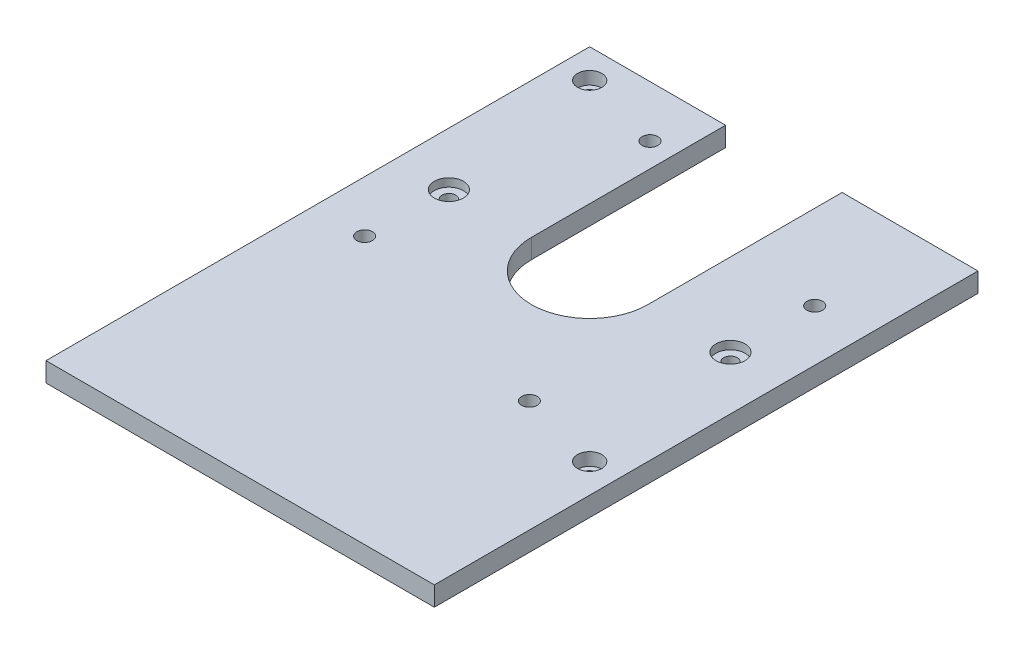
from build123d import *

# Parameters (mm, degrees)
SKETCH1_W                                           = 127
SKETCH1_H                                           = 127
BOSS_EXTRUDE1_DEPTH                                 = 6.35
CBORE_FOR_8_BINDING_HEAD_MACHINE_SCREW1_D           = 4.4958
CBORE_FOR_8_BINDING_HEAD_MACHINE_SCREW1_DEPTH       = 9.398
CBORE_FOR_8_BINDING_HEAD_MACHINE_SCREW1_CBORE_D     = 9.525
CBORE_FOR_8_BINDING_HEAD_MACHINE_SCREW1_CBORE_DEPTH = 2.667
CBORE_FOR_8_BINDING_HEAD_MACHINE_SCREW1_TIP         = 1.350674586
CBORE_FOR_8_SOCKET_HEAD_CAP_SCREW1_D                = 4.4958
CBORE_FOR_8_SOCKET_HEAD_CAP_SCREW1_DEPTH            = 9.398
CBORE_FOR_8_SOCKET_HEAD_CAP_SCREW1_CBORE_D          = 7.9375
CBORE_FOR_8_SOCKET_HEAD_CAP_SCREW1_CBORE_DEPTH      = 4.1656
CBORE_FOR_8_SOCKET_HEAD_CAP_SCREW1_TIP              = 1.350674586
F_1_4_20_TAPPED_HOLE1_D                             = 5.1054
F_1_4_20_TAPPED_HOLE1_DEPTH                         = 16.51
F_1_4_20_TAPPED_HOLE1_TIP                           = 1.533816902
CUT_EXTRUDE1_DEPTH                                  = 91.02678768
SKETCH9_W                                           = 127
SKETCH9_H                                           = 6.35
BOSS_EXTRUDE2_DEPTH                                 = 50.8


with BuildPart() as part:
    # Sketch1 → Boss-Extrude1 (new body)
    with BuildSketch(Plane(origin=(0, 0, 0), x_dir=(1, 0, 0), z_dir=(0, 1, 0))):
        Rectangle(SKETCH1_W, SKETCH1_H)
    extrude(amount=BOSS_EXTRUDE1_DEPTH)

    # CBORE for _8 Binding Head Machine Screw1
    with Locations(Plane(origin=(0, 6.35, 0), x_dir=(1, 0, 0), z_dir=(0, 1, 0))):
        with Locations((-46.0502, 0), (46.0502, 0)):
            CounterBoreHole(CBORE_FOR_8_BINDING_HEAD_MACHINE_SCREW1_D / 2, CBORE_FOR_8_BINDING_HEAD_MACHINE_SCREW1_CBORE_D / 2, CBORE_FOR_8_BINDING_HEAD_MACHINE_SCREW1_CBORE_DEPTH, depth=CBORE_FOR_8_BINDING_HEAD_MACHINE_SCREW1_DEPTH)
            with Locations((0, 0, -(CBORE_FOR_8_BINDING_HEAD_MACHINE_SCREW1_DEPTH + CBORE_FOR_8_BINDING_HEAD_MACHINE_SCREW1_TIP / 2))):  # 118° drill point
                Cone(0, CBORE_FOR_8_BINDING_HEAD_MACHINE_SCREW1_D / 2, CBORE_FOR_8_BINDING_HEAD_MACHINE_SCREW1_TIP, mode=Mode.SUBTRACT)

    # CBORE for _8 Socket Head Cap Screw1
    with Locations(Plane(origin=(0, 6.35, 0), x_dir=(1, 0, 0), z_dir=(0, 1, 0))):
        with Locations((-53.975, 53.975), (53.975, -53.975)):
            CounterBoreHole(CBORE_FOR_8_SOCKET_HEAD_CAP_SCREW1_D / 2, CBORE_FOR_8_SOCKET_HEAD_CAP_SCREW1_CBORE_D / 2, CBORE_FOR_8_SOCKET_HEAD_CAP_SCREW1_CBORE_DEPTH, depth=CBORE_FOR_8_SOCKET_HEAD_CAP_SCREW1_DEPTH)
            with Locations((0, 0, -(CBORE_FOR_8_SOCKET_HEAD_CAP_SCREW1_DEPTH + CBORE_FOR_8_SOCKET_HEAD_CAP_SCREW1_TIP / 2))):  # 118° drill point
                Cone(0, CBORE_FOR_8_SOCKET_HEAD_CAP_SCREW1_D / 2, CBORE_FOR_8_SOCKET_HEAD_CAP_SCREW1_TIP, mode=Mode.SUBTRACT)

    # 1_4-20 Tapped Hole1
    with Locations(Plane(origin=(0, 6.35, 0), x_dir=(1, 0, 0), z_dir=(0, 1, 0))):
        with Locations((-26.94051, 46.662332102), (-46.65990472, -26.939108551), (26.940006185, -46.661459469), (46.662331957, 26.940509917)):
            Hole(F_1_4_20_TAPPED_HOLE1_D / 2, depth=F_1_4_20_TAPPED_HOLE1_DEPTH)
            with Locations((0, 0, -(F_1_4_20_TAPPED_HOLE1_DEPTH + F_1_4_20_TAPPED_HOLE1_TIP / 2))):  # 118° drill point
                Cone(0, F_1_4_20_TAPPED_HOLE1_D / 2, F_1_4_20_TAPPED_HOLE1_TIP, mode=Mode.SUBTRACT)

    # Sketch8 → Cut-Extrude1 (cut, through all)
    with BuildSketch(Plane(origin=(0, 6.35, 0), x_dir=(1, 0, 0), z_dir=(0, 1, 0))):
        with BuildLine():
            Line((-19.05, 63.5), (-19.05, 0))
            ThreePointArc((-19.05, 0), (0, 19.05), (19.05, 0))
            Line((19.05, 0), (19.05, 63.5))
            Line((19.05, 63.5), (-19.05, 63.5))
        make_face()
        with BuildLine():
            ThreePointArc((19.05, 0), (0, 19.05), (-19.05, 0))
            Line((-19.05, 0), (19.05, 0))
        make_face()
        with BuildLine():
            Line((19.05, 0), (-19.05, 0))
            ThreePointArc((-19.05, 0), (0, -19.05), (19.05, 0))
        make_face()
        with BuildLine():
            ThreePointArc((19.05, 0), (0, 19.05), (-19.05, 0))
            Line((-19.05, 0), (19.05, 0))
        make_face()
        with BuildLine():
            Line((19.05, 0), (-19.05, 0))
            ThreePointArc((-19.05, 0), (0, -19.05), (19.05, 0))
        make_face()
    extrude(amount=-CUT_EXTRUDE1_DEPTH, mode=Mode.SUBTRACT)

    # Sketch9 → Boss-Extrude2 (add)
    with BuildSketch(Plane.XY.offset(63.5)):
        with Locations((0, 3.175)):
            Rectangle(SKETCH9_W, SKETCH9_H)
    extrude(amount=BOSS_EXTRUDE2_DEPTH)


solid = part.part
